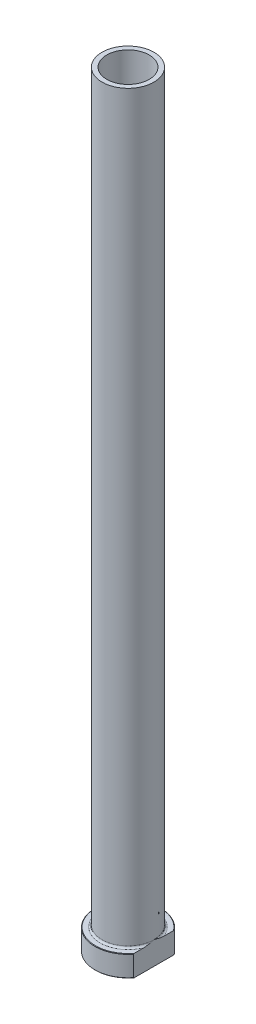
from build123d import *

# Parameters (mm, degrees)
FILLET1_R          = 0.8
CHAMFER1_SIZE      = 0.2
CUT_EXTRUDE1_DEPTH = 326.602518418
CHAMFER2_SIZE      = 0.5


with BuildPart() as part:
    # Sketch1 → Revolve1 (revolve)
    with BuildSketch(Plane.XY, mode=Mode.PRIVATE) as revolve1_sk:
        Polygon((-9, 325), (-11, 325), (-11, 9), (-14, 9), (-14, 0), (-9.25, 0), (-9.25, 258), (-9, 270), align=None)
    revolve(revolve1_sk.sketch.rotate(Axis((0, 92.187680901, 0), (0, -1, 0)), 270), axis=Axis((0, 92.187680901, 0), (0, -1, 0)))

    # Fillet1
    fillet1_edges = [part.edges().sort_by_distance(p)[0] for p in [
        (0, 9, -11),
    ]]
    fillet(fillet1_edges, radius=FILLET1_R)

    # Chamfer1
    chamfer1_edges = [part.edges().sort_by_distance(p)[0] for p in [
        (0, 0, -14),
        (0, 9, -14),
    ]]
    chamfer(chamfer1_edges, length=CHAMFER1_SIZE)

    # Sketch2 → Cut-Extrude1 (cut, through all)
    with BuildSketch(Plane.XZ):
        with BuildLine():
            Line((11, 8.660254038), (11, -8.660254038))
            ThreePointArc((11, -8.660254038), (14, 0), (11, 8.660254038))
        make_face()
    extrude(amount=-CUT_EXTRUDE1_DEPTH, mode=Mode.SUBTRACT)

    # Chamfer2
    chamfer2_edges = [part.edges().sort_by_distance(p)[0] for p in [
        (0, 0, -9.25),
    ]]
    chamfer(chamfer2_edges, length=CHAMFER2_SIZE)


solid = part.part
